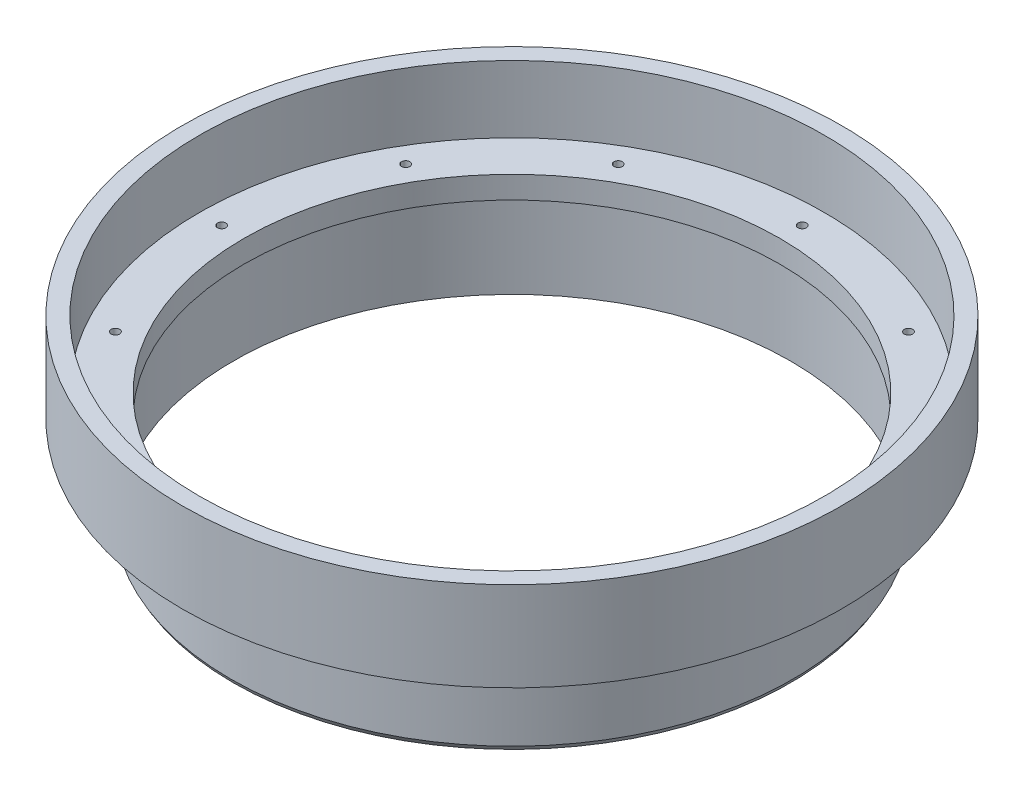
from build123d import *

# Parameters (mm, degrees)
SCREW_HOLES_COUNT = 12


with BuildPart() as part:
    # Cross Section → Main (revolve)
    with BuildSketch(Plane.XY, mode=Mode.PRIVATE) as main_sk:
        Polygon((-38.1, 0), (-38.1, -3.175), (-39.624, -3.175), (-39.624, -15.875), (-40.005, -15.215088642), (-40.005, -3.175), (-46.863, -3.175), (-46.863, 9.525), (-44.45, 9.525), (-44.45, 0), align=None)
    revolve(main_sk.sketch.rotate(Axis((0, 55, 0), (0, -1, 0)), 270), axis=Axis((0, 55, 0), (0, -1, 0)))

    # Sketch7 → 0-80 Tapped Hole1 (revolve, cut)
    with BuildSketch(Plane(origin=(-41.275, 0, 0), x_dir=(0, 0, 1), z_dir=(1, 0, 0))):
        Polygon((0, 0), (0, 3.532890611), (0.59563, 3.175), (0.59563, 0), align=None)
    f_0_80_tapped_hole1 = revolve(axis=Axis((-41.275, 6.35, 0), (0, -1, 0)), mode=Mode.SUBTRACT)

    # Screw Holes: 0-80 Tapped Hole1 ×12 about axis
    screw_holes_axis = Axis((0, 0, 0), (0, 1, 0))
    for i in range(1, SCREW_HOLES_COUNT):
        add(f_0_80_tapped_hole1.rotate(screw_holes_axis, i * 360 / SCREW_HOLES_COUNT), mode=Mode.SUBTRACT)


solid = part.part
